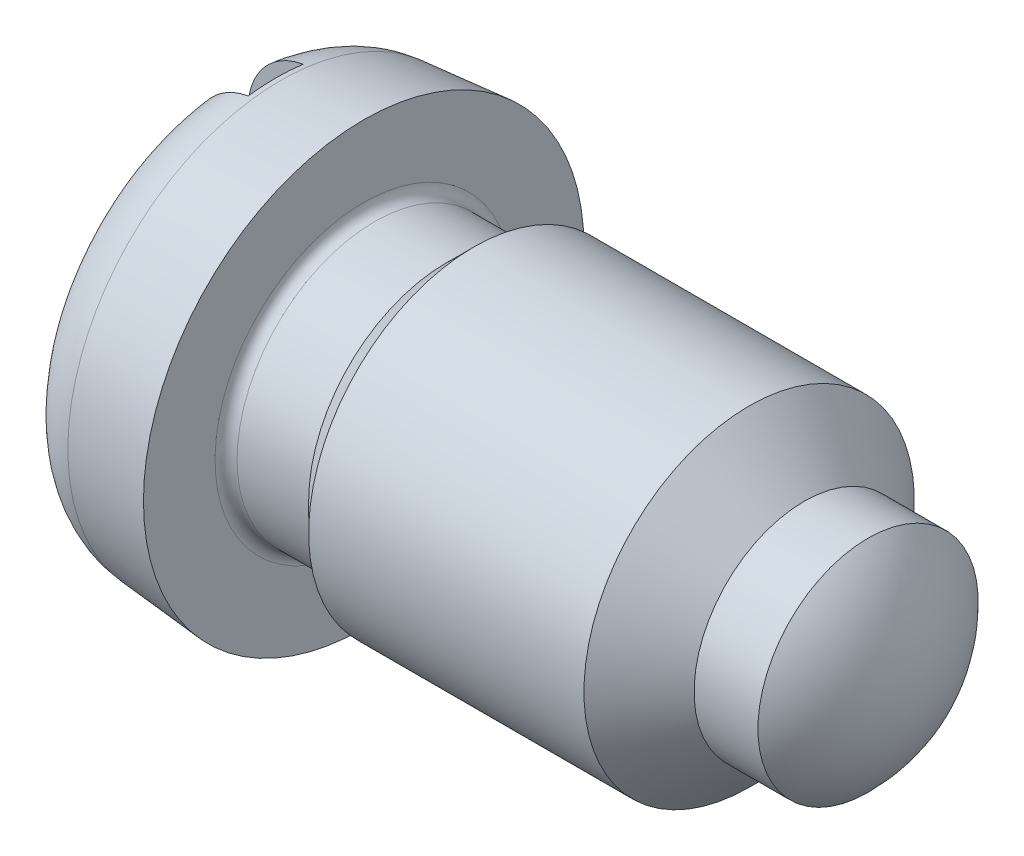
from build123d import *

# Parameters (mm, degrees)
FILLET1_R       = 0.6
FILLET2_R       = 0.1
SLOT_DEPTH      = 7.905794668
SLOT_DEPTH_BACK = 7.905794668
SKETCH2_W       = 0.5
SKETCH2_H       = 0.5


with BuildPart() as part:
    # Sketch1 → Base (revolve)
    with BuildSketch(Plane.XY, mode=Mode.PRIVATE) as base_sk:
        with BuildLine():
            Line((1.3, 1.5), (4.8, 1.5))
            Line((4.8, 1.5), (5.3, 1))
            Line((5.3, 1), (5.879795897, 1))
            ThreePointArc((5.879795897, 1), (6.190680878, 0.5423494), (6.3, 0))
            Line((6.3, 0), (0, 0))
            Line((0, 0), (0, 1.886264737))
            Line((0, 1.886264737), (1.3, 2))
            Line((1.3, 2), (1.3, 1.5))
        make_face()
    revolve(base_sk.sketch.rotate(Axis((1.3, 0, 0), (1, 0, 0)), 180), axis=Axis((1.3, 0, 0), (1, 0, 0)))

    # Fillet1
    fillet1_edges = [part.edges().sort_by_distance(p)[0] for p in [
        (0, 1.886264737, 0),
    ]]
    fillet(fillet1_edges, radius=FILLET1_R)

    # Sketch3 → Cut-Revolve1 (revolve, cut)
    with BuildSketch(Plane.XY, mode=Mode.PRIVATE) as cut_revolve1_sk:
        Polygon((1.3, 2), (1.3, 1.25), (2.05, 1.25), (2.3, 1.5), (2.3, 2), align=None)
    revolve(cut_revolve1_sk.sketch.rotate(Axis((0, 0, 0), (1, 0, 0)), 180), axis=Axis((0, 0, 0), (1, 0, 0)), mode=Mode.SUBTRACT)

    # Fillet2
    fillet2_edges = [part.edges().sort_by_distance(p)[0] for p in [
        (1.3, 1.25, 0),
    ]]
    fillet(fillet2_edges, radius=FILLET2_R)

    # Sketch2 → Slot (cut, two sides: drawn at the far end of the back side and taken through both)
    with BuildSketch(Plane(origin=(0, 0, 0), x_dir=(-1, 0, 0), z_dir=(0, -1, 0)).offset(-SLOT_DEPTH_BACK)):
        with Locations((-0.25, 0)):
            Rectangle(SKETCH2_W, SKETCH2_H)
    extrude(amount=SLOT_DEPTH + SLOT_DEPTH_BACK, mode=Mode.SUBTRACT)


solid = part.part
